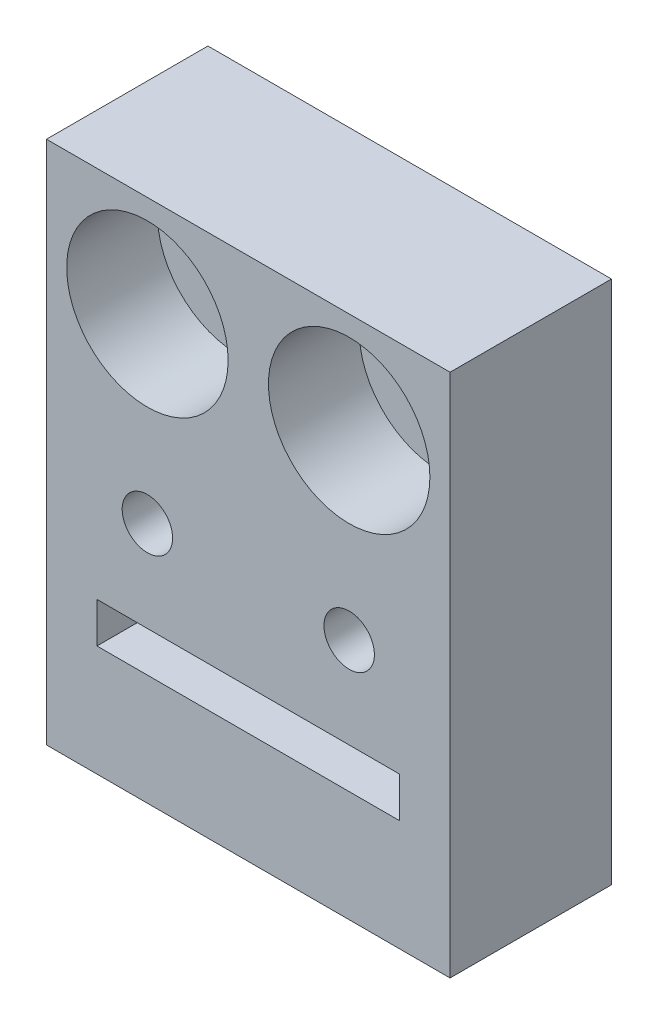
from build123d import *

# Parameters (mm, degrees)
SKETCH_1_W          = 20
SKETCH_1_H          = 26
SKETCH_1_R          = 2.25
SKETCH_1_R_2        = 1.25
SKETCH_1_W_2        = 15
SKETCH_1_H_2        = 2
EXTRUDE_1_DEPTH     = 8
SKETCH_2_R          = 4
CUT_EXTRUDE_1_DEPTH = 4.5


with BuildPart() as part:
    # Sketch 1 → Extrude 1 (new body)
    with BuildSketch(Plane.XY):
        with Locations((10, -13)):
            Rectangle(SKETCH_1_W, SKETCH_1_H)
        with Locations((5, -5)):
            Circle(SKETCH_1_R, mode=Mode.SUBTRACT)
        with Locations((15, -5)):
            Circle(SKETCH_1_R, mode=Mode.SUBTRACT)
        with Locations((5, -14)):
            Circle(SKETCH_1_R_2, mode=Mode.SUBTRACT)
        with Locations((15, -14)):
            Circle(SKETCH_1_R_2, mode=Mode.SUBTRACT)
        with Locations((10, -19.5)):
            Rectangle(SKETCH_1_W_2, SKETCH_1_H_2, mode=Mode.SUBTRACT)
    extrude(amount=EXTRUDE_1_DEPTH)

    # Sketch 2 → Cut-Extrude 1 (cut)
    with BuildSketch(Plane.XY.offset(8)):
        with Locations((5, -5)):
            Circle(SKETCH_2_R)
        with Locations((15, -5)):
            Circle(SKETCH_2_R)
    extrude(amount=-CUT_EXTRUDE_1_DEPTH, mode=Mode.SUBTRACT)


solid = part.part
